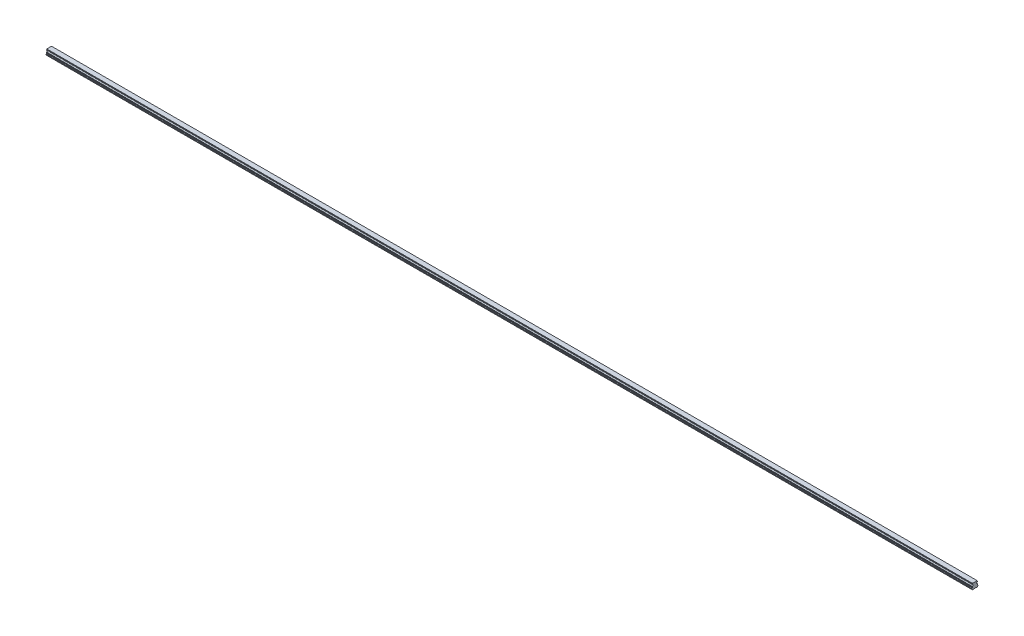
from build123d import *

# Parameters (mm, degrees)
BOSS_EXTRUDE1_DEPTH        = 3660
SKETCH3_R                  = 3
SKETCH3_R_2                = 2.5
CUT_EXTRUDE3_DEPTH         = 12
SKETCH3_2_R                = 2.5
CUT_EXTRUDE4_DEPTH         = 15
CHAMFER1_SIZE              = 0.5
LPATTERN4_COUNT            = 61
LPATTERN4_PITCH            = 60
CHAMFER1_OF_LPATTERN4_SIZE = 0.5


with BuildPart() as part:
    # Sketch1 → Boss-Extrude1 (new body)
    with BuildSketch(Plane(origin=(0, 0, 0), x_dir=(0, 0, -1), z_dir=(1, 0, 0))):
        with BuildLine():
            Line((9.375, 21.8), (-9.375, 21.8))
            Line((-9.375, 21.8), (-9.375, 20.756))
            Line((-9.375, 20.756), (-10, 19.415683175))
            Line((-10, 19.415683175), (-10, 17.685449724))
            ThreePointArc((-10, 17.685449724), (-7.2, 14.6), (-10, 11.514550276))
            Line((-10, 11.514550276), (-10, 9.784316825))
            Line((-10, 9.784316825), (-9.375, 8.444))
            Line((-9.375, 8.444), (-9.922688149, 6.4))
            Line((-9.922688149, 6.4), (-12.5, 5.489338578))
            Line((-12.5, 5.489338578), (-12.5, 2.65))
            Line((-12.5, 2.65), (-9.85, 0))
            Line((-9.85, 0), (-5.5, 0))
            Line((-5.5, 0), (-5, 0.5))
            Line((-5, 0.5), (5, 0.5))
            Line((5, 0.5), (5.5, 0))
            Line((5.5, 0), (9.85, 0))
            Line((9.85, 0), (12.5, 2.65))
            Line((12.5, 2.65), (12.5, 5.489338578))
            Line((12.5, 5.489338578), (9.922688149, 6.4))
            Line((9.922688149, 6.4), (9.375, 8.444))
            Line((9.375, 8.444), (10, 9.784316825))
            Line((10, 9.784316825), (10, 11.514550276))
            ThreePointArc((10, 11.514550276), (7.2, 14.6), (10, 17.685449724))
            Line((10, 17.685449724), (10, 19.415683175))
            Line((10, 19.415683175), (9.375, 20.756))
            Line((9.375, 20.756), (9.375, 21.8))
        make_face()
    extrude(amount=BOSS_EXTRUDE1_DEPTH)

    # Sketch3 → Cut-Extrude3 (cut)
    with BuildSketch(Plane.XZ):
        with Locations(Location((30, 0, 0), (0, 0, 270))):
            Circle(SKETCH3_R)
        with Locations(Location((30, 0, 0), (0, 0, 270))):
            Circle(SKETCH3_R_2, mode=Mode.SUBTRACT)
    cut_extrude3 = extrude(amount=-CUT_EXTRUDE3_DEPTH, mode=Mode.SUBTRACT)

    # Sketch3_2 → Cut-Extrude4 (cut)
    with BuildSketch(Plane.XZ):
        with Locations(Location((30, 0, 0), (0, 0, 270))):
            Circle(SKETCH3_2_R)
    cut_extrude4 = extrude(amount=-CUT_EXTRUDE4_DEPTH, mode=Mode.SUBTRACT)

    # Cut-Extrude5 cone 1 section (on through the dimple's axis) → Cut-Extrude5 (revolve, cut)
    with BuildSketch(Plane(origin=(30, 15, 0), x_dir=(0, 0, -1), z_dir=(1, 0, 0))):
        Polygon((0, 0), (2.5, 0), (0, 1.443375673), align=None)
    cut_extrude5 = revolve(axis=Axis((30, 15, 0), (0, 1, 0)), mode=Mode.SUBTRACT)

    # Chamfer1
    chamfer1_edges = [part.edges().sort_by_distance(p)[0] for p in [
        (30, 0.5, 3),
    ]]
    chamfer(chamfer1_edges, length=CHAMFER1_SIZE)

    # LPattern4: Cut-Extrude3, Cut-Extrude4, Cut-Extrude5 ×61
    with Locations(*[(i * LPATTERN4_PITCH, 0, 0) for i in range(1, LPATTERN4_COUNT)]):
        add(cut_extrude3, mode=Mode.SUBTRACT)
        add(cut_extrude4, mode=Mode.SUBTRACT)
        add(cut_extrude5, mode=Mode.SUBTRACT)

    # Chamfer1 of LPattern4
    chamfer1_of_lpattern4_edges = [part.edges().sort_by_distance(p)[0] for p in [
        (90, 0.5, 3),
        (150, 0.5, 3),
        (210, 0.5, 3),
        (270, 0.5, 3),
        (330, 0.5, 3),
        (390, 0.5, 3),
        (450, 0.5, 3),
        (510, 0.5, 3),
        (570, 0.5, 3),
        (630, 0.5, 3),
        (690, 0.5, 3),
        (750, 0.5, 3),
        (810, 0.5, 3),
        (870, 0.5, 3),
        (930, 0.5, 3),
        (990, 0.5, 3),
        (1050, 0.5, 3),
        (1110, 0.5, 3),
        (1170, 0.5, 3),
        (1230, 0.5, 3),
        (1290, 0.5, 3),
        (1350, 0.5, 3),
        (1410, 0.5, 3),
        (1470, 0.5, 3),
        (1530, 0.5, 3),
        (1590, 0.5, 3),
        (1650, 0.5, 3),
        (1710, 0.5, 3),
        (1770, 0.5, 3),
        (1830, 0.5, 3),
        (1890, 0.5, 3),
        (1950, 0.5, 3),
        (2010, 0.5, 3),
        (2070, 0.5, 3),
        (2130, 0.5, 3),
        (2190, 0.5, 3),
        (2250, 0.5, 3),
        (2310, 0.5, 3),
        (2370, 0.5, 3),
        (2430, 0.5, 3),
        (2490, 0.5, 3),
        (2550, 0.5, 3),
        (2610, 0.5, 3),
        (2670, 0.5, 3),
        (2730, 0.5, 3),
        (2790, 0.5, 3),
        (2850, 0.5, 3),
        (2910, 0.5, 3),
        (2970, 0.5, 3),
        (3030, 0.5, 3),
        (3090, 0.5, 3),
        (3150, 0.5, 3),
        (3210, 0.5, 3),
        (3270, 0.5, 3),
        (3330, 0.5, 3),
        (3390, 0.5, 3),
        (3450, 0.5, 3),
        (3510, 0.5, 3),
        (3570, 0.5, 3),
        (3630, 0.5, 3),
    ]]
    chamfer(chamfer1_of_lpattern4_edges, length=CHAMFER1_OF_LPATTERN4_SIZE)


solid = part.part
